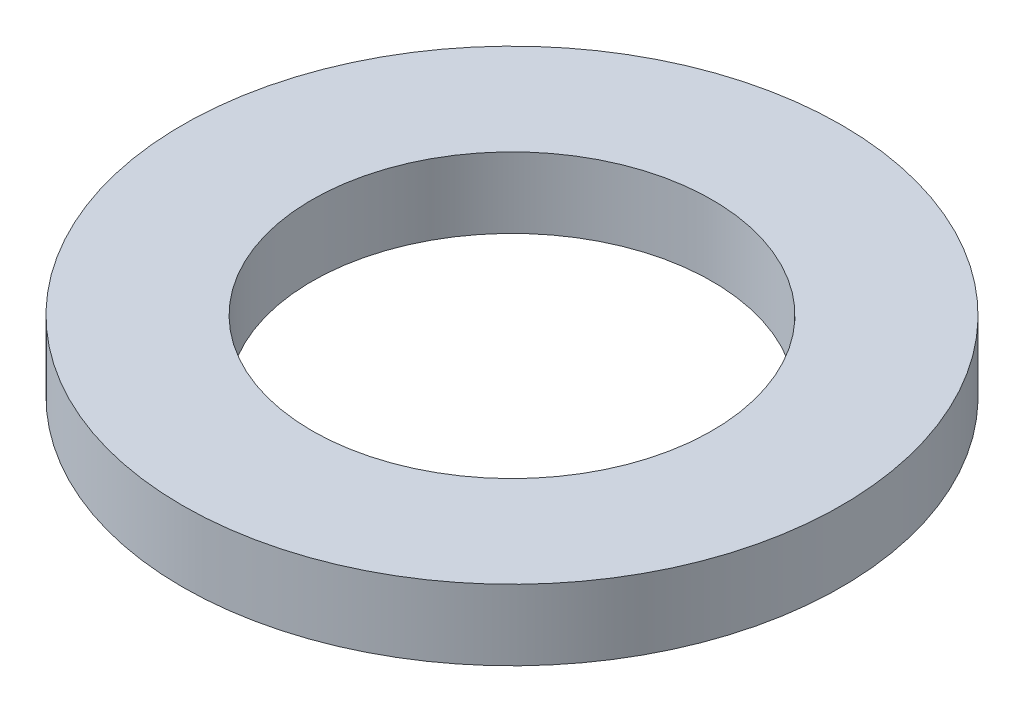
ISO-10303-21;
HEADER;
FILE_DESCRIPTION(('STEP AP214'),'2;1');
FILE_NAME('part.step','',(''),(''),'','','');
FILE_SCHEMA(('AUTOMOTIVE_DESIGN { 1 0 10303 214 1 1 1 1 }'));
ENDSEC;
DATA;
#1=APPLICATION_CONTEXT('core data for automotive mechanical design processes');
#2=APPLICATION_PROTOCOL_DEFINITION('international standard','automotive_design',2000,#1);
#3=PRODUCT_CONTEXT('',#1,'mechanical');
#4=PRODUCT('Part','Part','',(#3));
#5=PRODUCT_RELATED_PRODUCT_CATEGORY('part','',(#4));
#6=PRODUCT_DEFINITION_FORMATION('','',#4);
#7=PRODUCT_DEFINITION_CONTEXT('part definition',#1,'design');
#8=PRODUCT_DEFINITION('design','',#6,#7);
#9=PRODUCT_DEFINITION_SHAPE('','',#8);
#10=(LENGTH_UNIT() NAMED_UNIT(*) SI_UNIT(.MILLI.,.METRE.));
#11=(NAMED_UNIT(*) PLANE_ANGLE_UNIT() SI_UNIT($,.RADIAN.));
#12=(NAMED_UNIT(*) SI_UNIT($,.STERADIAN.) SOLID_ANGLE_UNIT());
#13=UNCERTAINTY_MEASURE_WITH_UNIT(LENGTH_MEASURE(1.E-05),#10,'distance_accuracy_value','');
#14=(GEOMETRIC_REPRESENTATION_CONTEXT(3) GLOBAL_UNCERTAINTY_ASSIGNED_CONTEXT((#13)) GLOBAL_UNIT_ASSIGNED_CONTEXT((#10,
#11,#12)) REPRESENTATION_CONTEXT('',''));
#15=CARTESIAN_POINT('',(0.,0.,0.));
#16=DIRECTION('',(0.,0.,1.));
#17=DIRECTION('',(1.,0.,0.));
#18=AXIS2_PLACEMENT_3D('',#15,#16,#17);
#19=CARTESIAN_POINT('',(0.,1.5,0.));
#20=DIRECTION('',(0.,1.,0.));
#21=DIRECTION('',(0.,0.,1.));
#22=AXIS2_PLACEMENT_3D('',#19,#20,#21);
#23=PLANE('',#22);
#24=CARTESIAN_POINT('',(0.,1.5,0.));
#25=DIRECTION('',(0.,1.,0.));
#26=DIRECTION('',(0.,0.,1.));
#27=AXIS2_PLACEMENT_3D('',#24,#25,#26);
#28=CIRCLE('',#27,7.);
#29=CARTESIAN_POINT('',(0.,1.5,7.));
#30=VERTEX_POINT('',#29);
#31=EDGE_CURVE('E10',#30,#30,#28,.T.);
#32=ORIENTED_EDGE('',*,*,#31,.T.);
#33=EDGE_LOOP('',(#32));
#34=FACE_BOUND('',#33,.T.);
#35=CARTESIAN_POINT('',(0.,1.5,0.));
#36=DIRECTION('',(0.,1.,0.));
#37=DIRECTION('',(0.,0.,1.));
#38=AXIS2_PLACEMENT_3D('',#35,#36,#37);
#39=CIRCLE('',#38,4.25);
#40=CARTESIAN_POINT('',(0.,1.5,4.25));
#41=VERTEX_POINT('',#40);
#42=EDGE_CURVE('E48',#41,#41,#39,.T.);
#43=ORIENTED_EDGE('',*,*,#42,.F.);
#44=EDGE_LOOP('',(#43));
#45=FACE_BOUND('',#44,.T.);
#46=ADVANCED_FACE('F37',(#34,#45),#23,.T.);
#47=CARTESIAN_POINT('',(0.,0.,0.));
#48=DIRECTION('',(0.,1.,0.));
#49=DIRECTION('',(0.,0.,1.));
#50=AXIS2_PLACEMENT_3D('',#47,#48,#49);
#51=PLANE('',#50);
#52=CARTESIAN_POINT('',(0.,0.,0.));
#53=DIRECTION('',(0.,1.,0.));
#54=DIRECTION('',(0.,0.,1.));
#55=AXIS2_PLACEMENT_3D('',#52,#53,#54);
#56=CIRCLE('',#55,7.);
#57=CARTESIAN_POINT('',(0.,0.,7.));
#58=VERTEX_POINT('',#57);
#59=EDGE_CURVE('E41',#58,#58,#56,.T.);
#60=ORIENTED_EDGE('',*,*,#59,.F.);
#61=EDGE_LOOP('',(#60));
#62=FACE_BOUND('',#61,.T.);
#63=CARTESIAN_POINT('',(0.,0.,0.));
#64=DIRECTION('',(0.,1.,0.));
#65=DIRECTION('',(0.,0.,1.));
#66=AXIS2_PLACEMENT_3D('',#63,#64,#65);
#67=CIRCLE('',#66,4.25);
#68=CARTESIAN_POINT('',(0.,0.,4.25));
#69=VERTEX_POINT('',#68);
#70=EDGE_CURVE('E50',#69,#69,#67,.T.);
#71=ORIENTED_EDGE('',*,*,#70,.T.);
#72=EDGE_LOOP('',(#71));
#73=FACE_BOUND('',#72,.T.);
#74=ADVANCED_FACE('F60',(#62,#73),#51,.F.);
#75=CARTESIAN_POINT('',(0.,1.5,0.));
#76=DIRECTION('',(0.,-1.,0.));
#77=DIRECTION('',(0.,0.,-1.));
#78=AXIS2_PLACEMENT_3D('',#75,#76,#77);
#79=CYLINDRICAL_SURFACE('',#78,7.);
#80=ORIENTED_EDGE('',*,*,#31,.F.);
#81=EDGE_LOOP('',(#80));
#82=FACE_BOUND('',#81,.T.);
#83=ORIENTED_EDGE('',*,*,#59,.T.);
#84=EDGE_LOOP('',(#83));
#85=FACE_BOUND('',#84,.T.);
#86=ADVANCED_FACE('F39',(#82,#85),#79,.T.);
#87=CARTESIAN_POINT('',(0.,1.5,0.));
#88=DIRECTION('',(0.,-1.,0.));
#89=DIRECTION('',(0.,0.,-1.));
#90=AXIS2_PLACEMENT_3D('',#87,#88,#89);
#91=CYLINDRICAL_SURFACE('',#90,4.25);
#92=ORIENTED_EDGE('',*,*,#42,.T.);
#93=EDGE_LOOP('',(#92));
#94=FACE_BOUND('',#93,.T.);
#95=ORIENTED_EDGE('',*,*,#70,.F.);
#96=EDGE_LOOP('',(#95));
#97=FACE_BOUND('',#96,.T.);
#98=ADVANCED_FACE('F56',(#94,#97),#91,.F.);
#99=CLOSED_SHELL('',(#46,#74,#86,#98));
#100=MANIFOLD_SOLID_BREP('B2',#99);
#101=ADVANCED_BREP_SHAPE_REPRESENTATION('',(#18,#100),#14);
#102=SHAPE_DEFINITION_REPRESENTATION(#9,#101);
ENDSEC;
END-ISO-10303-21;
